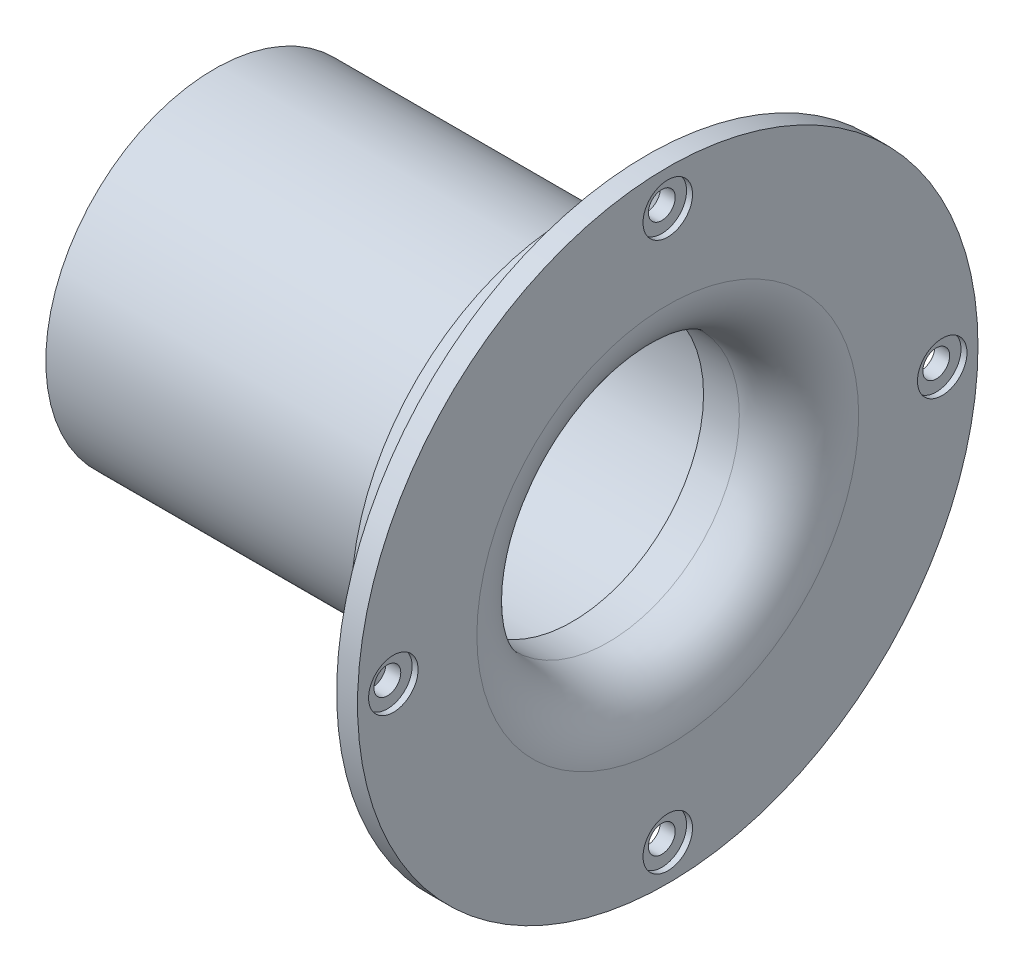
from build123d import *

# Parameters (mm, degrees)
SKETCH_2_R          = 2.25
CUT_EXTRUDE_1_DEPTH = 3.5
SKETCH_3_R          = 4.15
CUT_EXTRUDE_2_DEPTH = 1


with BuildPart() as part:
    # Sketch 1 → Revolve 1 (revolve)
    with BuildSketch(Plane(origin=(0, 0, 0), x_dir=(1, 0, 0), z_dir=(0, 1, 0))):
        with BuildLine():
            Line((-76, 28.25), (-16, 28.25))
            Line((-16, 28.25), (-16, 37))
            Line((-16, 37), (-3.5, 37))
            Line((-3.5, 37), (-3.5, 52))
            Line((-3.5, 52), (0, 52))
            Line((0, 52), (0, 32))
            ThreePointArc((0, 32), (-2.928932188, 24.928932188), (-10, 22))
            Line((-10, 22), (-16, 22))
            Line((-16, 22), (-16, 25.25))
            Line((-16, 25.25), (-76, 25.25))
            Line((-76, 25.25), (-76, 28.25))
        make_face()
    revolve(axis=Axis((0, 0, 0), (-1, 0, 0)))

    # Sketch 2 → Cut-Extrude 1 (cut)
    with BuildSketch(Plane(origin=(0, 0, 0), x_dir=(0, 0, -1), z_dir=(1, 0, 0))):
        with Locations((-46, 0)):
            Circle(SKETCH_2_R)
        with Locations((0, 46)):
            Circle(SKETCH_2_R)
        with Locations((46, 0)):
            Circle(SKETCH_2_R)
        with Locations((0, -46)):
            Circle(SKETCH_2_R)
    extrude(amount=-CUT_EXTRUDE_1_DEPTH, mode=Mode.SUBTRACT)

    # Sketch 3 → Cut-Extrude 2 (cut)
    with BuildSketch(Plane(origin=(0, 0, 0), x_dir=(0, 0, -1), z_dir=(1, 0, 0))):
        with Locations((-46, 0)):
            Circle(SKETCH_3_R)
        with Locations((0, 46)):
            Circle(SKETCH_3_R)
        with Locations((46, 0)):
            Circle(SKETCH_3_R)
        with Locations((0, -46)):
            Circle(SKETCH_3_R)
    extrude(amount=-CUT_EXTRUDE_2_DEPTH, mode=Mode.SUBTRACT)


solid = part.part
